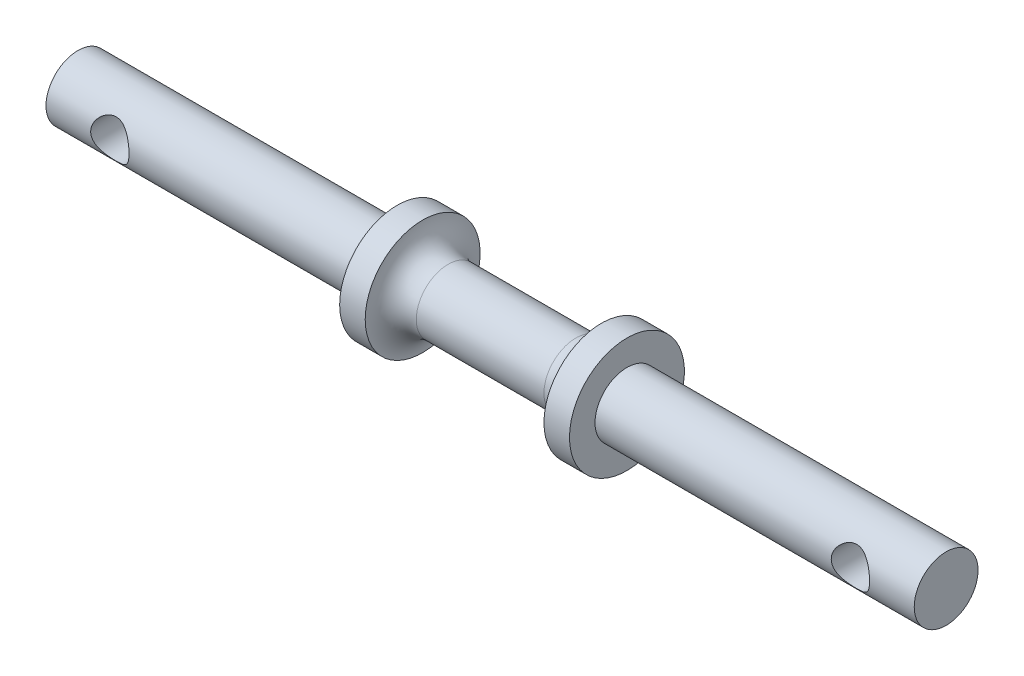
ISO-10303-21;
HEADER;
FILE_DESCRIPTION(('STEP AP214'),'2;1');
FILE_NAME('part.step','',(''),(''),'','','');
FILE_SCHEMA(('AUTOMOTIVE_DESIGN { 1 0 10303 214 1 1 1 1 }'));
ENDSEC;
DATA;
#1=APPLICATION_CONTEXT('core data for automotive mechanical design processes');
#2=APPLICATION_PROTOCOL_DEFINITION('international standard','automotive_design',2000,#1);
#3=PRODUCT_CONTEXT('',#1,'mechanical');
#4=PRODUCT('Part','Part','',(#3));
#5=PRODUCT_RELATED_PRODUCT_CATEGORY('part','',(#4));
#6=PRODUCT_DEFINITION_FORMATION('','',#4);
#7=PRODUCT_DEFINITION_CONTEXT('part definition',#1,'design');
#8=PRODUCT_DEFINITION('design','',#6,#7);
#9=PRODUCT_DEFINITION_SHAPE('','',#8);
#10=(LENGTH_UNIT() NAMED_UNIT(*) SI_UNIT(.MILLI.,.METRE.));
#11=(NAMED_UNIT(*) PLANE_ANGLE_UNIT() SI_UNIT($,.RADIAN.));
#12=(NAMED_UNIT(*) SI_UNIT($,.STERADIAN.) SOLID_ANGLE_UNIT());
#13=UNCERTAINTY_MEASURE_WITH_UNIT(LENGTH_MEASURE(1.E-05),#10,'distance_accuracy_value','');
#14=(GEOMETRIC_REPRESENTATION_CONTEXT(3) GLOBAL_UNCERTAINTY_ASSIGNED_CONTEXT((#13)) GLOBAL_UNIT_ASSIGNED_CONTEXT((#10,
#11,#12)) REPRESENTATION_CONTEXT('',''));
#15=CARTESIAN_POINT('',(0.,0.,0.));
#16=DIRECTION('',(0.,0.,1.));
#17=DIRECTION('',(1.,0.,0.));
#18=AXIS2_PLACEMENT_3D('',#15,#16,#17);
#19=CARTESIAN_POINT('',(0.,0.,0.));
#20=DIRECTION('',(1.,0.,0.));
#21=DIRECTION('',(0.,0.,-1.));
#22=AXIS2_PLACEMENT_3D('',#19,#20,#21);
#23=PLANE('',#22);
#24=CARTESIAN_POINT('',(0.,0.,0.));
#25=DIRECTION('',(-1.,0.,0.));
#26=DIRECTION('',(0.,0.,1.));
#27=AXIS2_PLACEMENT_3D('',#24,#25,#26);
#28=CIRCLE('',#27,2.5);
#29=CARTESIAN_POINT('',(0.,0.,2.5));
#30=VERTEX_POINT('',#29);
#31=EDGE_CURVE('E98',#30,#30,#28,.T.);
#32=ORIENTED_EDGE('',*,*,#31,.T.);
#33=EDGE_LOOP('',(#32));
#34=FACE_BOUND('',#33,.T.);
#35=ADVANCED_FACE('F28',(#34),#23,.F.);
#36=CARTESIAN_POINT('',(68.,0.,0.));
#37=DIRECTION('',(-1.,0.,0.));
#38=DIRECTION('',(0.,0.,1.));
#39=AXIS2_PLACEMENT_3D('',#36,#37,#38);
#40=PLANE('',#39);
#41=CARTESIAN_POINT('',(68.,0.,0.));
#42=DIRECTION('',(-1.,0.,0.));
#43=DIRECTION('',(0.,0.,1.));
#44=AXIS2_PLACEMENT_3D('',#41,#42,#43);
#45=CIRCLE('',#44,2.5);
#46=CARTESIAN_POINT('',(68.,0.,2.5));
#47=VERTEX_POINT('',#46);
#48=EDGE_CURVE('E10',#47,#47,#45,.T.);
#49=ORIENTED_EDGE('',*,*,#48,.F.);
#50=EDGE_LOOP('',(#49));
#51=FACE_BOUND('',#50,.T.);
#52=ADVANCED_FACE('F90',(#51),#40,.F.);
#53=CARTESIAN_POINT('',(0.,0.,0.));
#54=DIRECTION('',(-1.,0.,0.));
#55=DIRECTION('',(0.,0.,1.));
#56=AXIS2_PLACEMENT_3D('',#53,#54,#55);
#57=CYLINDRICAL_SURFACE('',#56,2.5);
#58=CARTESIAN_POINT('',(64.5,0.,2.5));
#59=CARTESIAN_POINT('',(64.4999959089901,-0.076729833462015,2.49999625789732));
#60=CARTESIAN_POINT('',(64.4940713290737,-0.153582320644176,2.4964290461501));
#61=CARTESIAN_POINT('',(64.4706756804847,-0.304975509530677,2.48249903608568));
#62=CARTESIAN_POINT('',(64.4531761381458,-0.379510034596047,2.47211948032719));
#63=CARTESIAN_POINT('',(64.4076136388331,-0.523751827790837,2.44561558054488));
#64=CARTESIAN_POINT('',(64.3796030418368,-0.593481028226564,2.42951973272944));
#65=CARTESIAN_POINT('',(64.314139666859,-0.727030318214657,2.39295367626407));
#66=CARTESIAN_POINT('',(64.2766892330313,-0.790851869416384,2.37248455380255));
#67=CARTESIAN_POINT('',(64.1902251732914,-0.916299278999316,2.32705360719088));
#68=CARTESIAN_POINT('',(64.1405463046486,-0.977384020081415,2.30186792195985));
#69=CARTESIAN_POINT('',(64.0325327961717,-1.09088270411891,2.25030439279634));
#70=CARTESIAN_POINT('',(63.9741870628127,-1.14328534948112,2.22392505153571));
#71=CARTESIAN_POINT('',(63.8420764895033,-1.24444996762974,2.1691106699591));
#72=CARTESIAN_POINT('',(63.7672982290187,-1.29197766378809,2.14082017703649));
#73=CARTESIAN_POINT('',(63.6091534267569,-1.37361437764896,2.08938301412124));
#74=CARTESIAN_POINT('',(63.5258011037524,-1.40774517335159,2.06622802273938));
#75=CARTESIAN_POINT('',(63.3734035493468,-1.45440601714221,2.0335462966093));
#76=CARTESIAN_POINT('',(63.3057640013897,-1.47016197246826,2.02207883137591));
#77=CARTESIAN_POINT('',(63.1681962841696,-1.49216172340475,2.00590308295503));
#78=CARTESIAN_POINT('',(63.0982710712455,-1.49841734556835,2.0011863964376));
#79=CARTESIAN_POINT('',(62.9579885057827,-1.50105508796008,1.99920922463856));
#80=CARTESIAN_POINT('',(62.8876305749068,-1.49741783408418,2.00196337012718));
#81=CARTESIAN_POINT('',(62.7487212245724,-1.48046060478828,2.01453261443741));
#82=CARTESIAN_POINT('',(62.6801712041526,-1.46713334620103,2.02435302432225));
#83=CARTESIAN_POINT('',(62.5474697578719,-1.43173921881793,2.04953186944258));
#84=CARTESIAN_POINT('',(62.4832729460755,-1.40978748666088,2.06481711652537));
#85=CARTESIAN_POINT('',(62.3593050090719,-1.35795061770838,2.09927051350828));
#86=CARTESIAN_POINT('',(62.2995355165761,-1.32806257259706,2.11844008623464));
#87=CARTESIAN_POINT('',(62.1750159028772,-1.25517983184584,2.16255327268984));
#88=CARTESIAN_POINT('',(62.1112219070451,-1.21080724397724,2.18792043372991));
#89=CARTESIAN_POINT('',(61.991323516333,-1.11291092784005,2.2393059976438));
#90=CARTESIAN_POINT('',(61.9352265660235,-1.0593784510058,2.26532500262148));
#91=CARTESIAN_POINT('',(61.8243870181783,-0.935811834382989,2.31935504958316));
#92=CARTESIAN_POINT('',(61.770922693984,-0.864517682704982,2.34713836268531));
#93=CARTESIAN_POINT('',(61.6768779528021,-0.712276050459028,2.3977242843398));
#94=CARTESIAN_POINT('',(61.6362906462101,-0.631333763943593,2.42052955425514));
#95=CARTESIAN_POINT('',(61.5720678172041,-0.467197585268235,2.45730392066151));
#96=CARTESIAN_POINT('',(61.5475246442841,-0.384467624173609,2.47173957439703));
#97=CARTESIAN_POINT('',(61.5129888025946,-0.215047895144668,2.4921884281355));
#98=CARTESIAN_POINT('',(61.5029786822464,-0.128363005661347,2.49821172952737));
#99=CARTESIAN_POINT('',(61.4984921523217,0.0337146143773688,2.5009057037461));
#100=CARTESIAN_POINT('',(61.5020911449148,0.10904247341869,2.49873521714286));
#101=CARTESIAN_POINT('',(61.5204258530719,0.257829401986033,2.48778712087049));
#102=CARTESIAN_POINT('',(61.5351613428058,0.331288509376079,2.47900964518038));
#103=CARTESIAN_POINT('',(61.5745434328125,0.472574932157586,2.45594792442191));
#104=CARTESIAN_POINT('',(61.5989403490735,0.540495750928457,2.44180275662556));
#105=CARTESIAN_POINT('',(61.6566773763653,0.671265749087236,2.40913880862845));
#106=CARTESIAN_POINT('',(61.6900192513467,0.734113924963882,2.39061916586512));
#107=CARTESIAN_POINT('',(61.7685569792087,0.860006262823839,2.34845496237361));
#108=CARTESIAN_POINT('',(61.8146238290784,0.922394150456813,2.32447802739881));
#109=CARTESIAN_POINT('',(61.9153913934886,1.03902603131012,2.27474265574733));
#110=CARTESIAN_POINT('',(61.9701021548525,1.09326040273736,2.24898216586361));
#111=CARTESIAN_POINT('',(62.0949103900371,1.19931996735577,2.19445423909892));
#112=CARTESIAN_POINT('',(62.1660838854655,1.24991019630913,2.16573241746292));
#113=CARTESIAN_POINT('',(62.3172160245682,1.33845238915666,2.11216182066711));
#114=CARTESIAN_POINT('',(62.3971652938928,1.37641766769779,2.08730897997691));
#115=CARTESIAN_POINT('',(62.5462430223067,1.43142578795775,2.0498490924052));
#116=CARTESIAN_POINT('',(62.6139803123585,1.45121625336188,2.0357565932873));
#117=CARTESIAN_POINT('',(62.7525320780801,1.48113663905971,2.01409605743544));
#118=CARTESIAN_POINT('',(62.8233421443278,1.4912799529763,2.00651897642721));
#119=CARTESIAN_POINT('',(62.966376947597,1.50134130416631,1.99900446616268));
#120=CARTESIAN_POINT('',(63.038605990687,1.50122089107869,1.99909576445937));
#121=CARTESIAN_POINT('',(63.1818944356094,1.49066472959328,2.0069771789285));
#122=CARTESIAN_POINT('',(63.2529531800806,1.48022337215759,2.0147714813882));
#123=CARTESIAN_POINT('',(63.3884884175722,1.45040174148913,2.0363318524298));
#124=CARTESIAN_POINT('',(63.4531170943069,1.43147636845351,2.0497921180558));
#125=CARTESIAN_POINT('',(63.5783372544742,1.38563242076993,2.08105501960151));
#126=CARTESIAN_POINT('',(63.6389272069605,1.3587108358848,2.09885929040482));
#127=CARTESIAN_POINT('',(63.7643198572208,1.29289245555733,2.14012990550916));
#128=CARTESIAN_POINT('',(63.8283411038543,1.25279167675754,2.16404587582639));
#129=CARTESIAN_POINT('',(63.9493800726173,1.16375698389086,2.21320127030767));
#130=CARTESIAN_POINT('',(64.0063919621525,1.114815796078,2.2384417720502));
#131=CARTESIAN_POINT('',(64.1213509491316,1.00009777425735,2.29225690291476));
#132=CARTESIAN_POINT('',(64.1779310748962,0.932876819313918,2.32070308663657));
#133=CARTESIAN_POINT('',(64.2790978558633,0.788462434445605,2.37365428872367));
#134=CARTESIAN_POINT('',(64.3236802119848,0.711265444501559,2.39815789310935));
#135=CARTESIAN_POINT('',(64.3977858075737,0.551125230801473,2.43985578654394));
#136=CARTESIAN_POINT('',(64.4277280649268,0.468430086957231,2.45725077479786));
#137=CARTESIAN_POINT('',(64.472724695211,0.297973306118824,2.48366273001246));
#138=CARTESIAN_POINT('',(64.487835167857,0.210232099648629,2.49271125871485));
#139=CARTESIAN_POINT('',(64.4966974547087,0.10155809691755,2.49802001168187));
#140=CARTESIAN_POINT('',(64.4979344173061,0.0812762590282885,2.49876114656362));
#141=CARTESIAN_POINT('',(64.4995862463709,0.0406658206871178,2.49975164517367));
#142=CARTESIAN_POINT('',(64.5000010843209,0.0203372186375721,2.50000099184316));
#143=CARTESIAN_POINT('',(64.5,0.,2.5));
#144=B_SPLINE_CURVE_WITH_KNOTS('',3,(#58,#59,#60,#61,#62,#63,#64,#65,#66,#67,#68,#69,#70,#71,
#72,#73,#74,#75,#76,#77,#78,#79,#80,#81,#82,#83,#84,#85,#86,#87,#88,#89,#90,#91,#92,#93,#94,#95,
#96,#97,#98,#99,#100,#101,#102,#103,#104,#105,#106,#107,#108,#109,#110,#111,#112,#113,#114,#115,
#116,#117,#118,#119,#120,#121,#122,#123,#124,#125,#126,#127,#128,#129,#130,#131,#132,#133,#134,
#135,#136,#137,#138,#139,#140,#141,#142,#143),.UNSPECIFIED.,.T.,.F.,(4,2,2,2,2,2,2,2,2,2,2,2,2,
2,2,2,2,2,2,2,2,2,2,2,2,2,2,2,2,2,2,2,2,2,2,2,2,2,2,2,2,2,4),(0.,0.230102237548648,
0.460772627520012,0.690308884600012,0.919788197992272,1.16681590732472,1.414162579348,
1.69183813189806,1.96906040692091,2.17933829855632,2.38935420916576,2.59978170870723,
2.81036753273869,3.01823267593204,3.22617409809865,3.47046995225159,3.7150004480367,
3.99360957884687,4.2720693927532,4.53296790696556,4.79355286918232,5.01875602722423,
5.24395461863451,5.46367785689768,5.68344445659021,5.92601365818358,6.16886690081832,
6.44336762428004,6.71757792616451,6.93257787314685,7.14727888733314,7.3627842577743,
7.57840681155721,7.78364098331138,7.98895251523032,8.22578610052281,8.46281544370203,
8.73854311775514,9.01436946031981,9.28175654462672,9.54812832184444,9.60911473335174,
9.67010326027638),.UNSPECIFIED.);
#145=CARTESIAN_POINT('',(64.5,0.,2.5));
#146=VERTEX_POINT('',#145);
#147=EDGE_CURVE('E55',#146,#146,#144,.T.);
#148=ORIENTED_EDGE('',*,*,#147,.T.);
#149=EDGE_LOOP('',(#148));
#150=FACE_BOUND('',#149,.T.);
#151=CARTESIAN_POINT('',(64.5,0.,-2.5));
#152=CARTESIAN_POINT('',(64.4999959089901,0.0767298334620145,-2.49999625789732));
#153=CARTESIAN_POINT('',(64.4940713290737,0.153582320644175,-2.4964290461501));
#154=CARTESIAN_POINT('',(64.4706756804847,0.304975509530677,-2.48249903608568));
#155=CARTESIAN_POINT('',(64.4531761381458,0.379510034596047,-2.47211948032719));
#156=CARTESIAN_POINT('',(64.4076136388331,0.523751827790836,-2.44561558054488));
#157=CARTESIAN_POINT('',(64.3796030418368,0.593481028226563,-2.42951973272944));
#158=CARTESIAN_POINT('',(64.314139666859,0.727030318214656,-2.39295367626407));
#159=CARTESIAN_POINT('',(64.2766892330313,0.790851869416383,-2.37248455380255));
#160=CARTESIAN_POINT('',(64.1902251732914,0.916299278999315,-2.32705360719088));
#161=CARTESIAN_POINT('',(64.1405463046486,0.977384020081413,-2.30186792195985));
#162=CARTESIAN_POINT('',(64.0325327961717,1.09088270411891,-2.25030439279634));
#163=CARTESIAN_POINT('',(63.9741870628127,1.14328534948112,-2.22392505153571));
#164=CARTESIAN_POINT('',(63.8420764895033,1.24444996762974,-2.1691106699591));
#165=CARTESIAN_POINT('',(63.7672982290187,1.29197766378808,-2.14082017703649));
#166=CARTESIAN_POINT('',(63.6091534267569,1.37361437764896,-2.08938301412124));
#167=CARTESIAN_POINT('',(63.5258011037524,1.40774517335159,-2.06622802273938));
#168=CARTESIAN_POINT('',(63.3734035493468,1.45440601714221,-2.0335462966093));
#169=CARTESIAN_POINT('',(63.3057640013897,1.47016197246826,-2.02207883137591));
#170=CARTESIAN_POINT('',(63.1681962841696,1.49216172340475,-2.00590308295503));
#171=CARTESIAN_POINT('',(63.0982710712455,1.49841734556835,-2.0011863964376));
#172=CARTESIAN_POINT('',(62.9579885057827,1.50105508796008,-1.99920922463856));
#173=CARTESIAN_POINT('',(62.8876305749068,1.49741783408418,-2.00196337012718));
#174=CARTESIAN_POINT('',(62.7487212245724,1.48046060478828,-2.01453261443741));
#175=CARTESIAN_POINT('',(62.6801712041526,1.46713334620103,-2.02435302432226));
#176=CARTESIAN_POINT('',(62.5474697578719,1.43173921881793,-2.04953186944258));
#177=CARTESIAN_POINT('',(62.4832729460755,1.40978748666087,-2.06481711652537));
#178=CARTESIAN_POINT('',(62.3593050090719,1.35795061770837,-2.09927051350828));
#179=CARTESIAN_POINT('',(62.2995355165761,1.32806257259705,-2.11844008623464));
#180=CARTESIAN_POINT('',(62.1750159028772,1.25517983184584,-2.16255327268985));
#181=CARTESIAN_POINT('',(62.1112219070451,1.21080724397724,-2.18792043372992));
#182=CARTESIAN_POINT('',(61.991323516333,1.11291092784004,-2.2393059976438));
#183=CARTESIAN_POINT('',(61.9352265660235,1.0593784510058,-2.26532500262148));
#184=CARTESIAN_POINT('',(61.8243870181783,0.935811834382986,-2.31935504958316));
#185=CARTESIAN_POINT('',(61.770922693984,0.864517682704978,-2.34713836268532));
#186=CARTESIAN_POINT('',(61.6768779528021,0.712276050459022,-2.3977242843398));
#187=CARTESIAN_POINT('',(61.6362906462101,0.631333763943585,-2.42052955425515));
#188=CARTESIAN_POINT('',(61.5720678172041,0.467197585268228,-2.45730392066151));
#189=CARTESIAN_POINT('',(61.5475246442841,0.384467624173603,-2.47173957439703));
#190=CARTESIAN_POINT('',(61.5129888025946,0.215047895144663,-2.4921884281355));
#191=CARTESIAN_POINT('',(61.5029786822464,0.128363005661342,-2.49821172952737));
#192=CARTESIAN_POINT('',(61.4984921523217,-0.0337146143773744,-2.5009057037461));
#193=CARTESIAN_POINT('',(61.5020911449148,-0.109042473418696,-2.49873521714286));
#194=CARTESIAN_POINT('',(61.5204258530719,-0.257829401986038,-2.48778712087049));
#195=CARTESIAN_POINT('',(61.5351613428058,-0.331288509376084,-2.47900964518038));
#196=CARTESIAN_POINT('',(61.5745434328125,-0.472574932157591,-2.45594792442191));
#197=CARTESIAN_POINT('',(61.5989403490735,-0.540495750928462,-2.44180275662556));
#198=CARTESIAN_POINT('',(61.6566773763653,-0.671265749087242,-2.40913880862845));
#199=CARTESIAN_POINT('',(61.6900192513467,-0.734113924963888,-2.39061916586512));
#200=CARTESIAN_POINT('',(61.7685569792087,-0.860006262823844,-2.34845496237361));
#201=CARTESIAN_POINT('',(61.8146238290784,-0.922394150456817,-2.32447802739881));
#202=CARTESIAN_POINT('',(61.9153913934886,-1.03902603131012,-2.27474265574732));
#203=CARTESIAN_POINT('',(61.9701021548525,-1.09326040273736,-2.24898216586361));
#204=CARTESIAN_POINT('',(62.0949103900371,-1.19931996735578,-2.19445423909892));
#205=CARTESIAN_POINT('',(62.1660838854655,-1.24991019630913,-2.16573241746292));
#206=CARTESIAN_POINT('',(62.3172160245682,-1.33845238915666,-2.11216182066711));
#207=CARTESIAN_POINT('',(62.3971652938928,-1.3764176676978,-2.0873089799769));
#208=CARTESIAN_POINT('',(62.5462430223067,-1.43142578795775,-2.0498490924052));
#209=CARTESIAN_POINT('',(62.6139803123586,-1.45121625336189,-2.03575659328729));
#210=CARTESIAN_POINT('',(62.7525320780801,-1.48113663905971,-2.01409605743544));
#211=CARTESIAN_POINT('',(62.8233421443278,-1.4912799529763,-2.00651897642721));
#212=CARTESIAN_POINT('',(62.966376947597,-1.50134130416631,-1.99900446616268));
#213=CARTESIAN_POINT('',(63.038605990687,-1.50122089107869,-1.99909576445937));
#214=CARTESIAN_POINT('',(63.1818944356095,-1.49066472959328,-2.0069771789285));
#215=CARTESIAN_POINT('',(63.2529531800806,-1.48022337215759,-2.0147714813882));
#216=CARTESIAN_POINT('',(63.3884884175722,-1.45040174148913,-2.0363318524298));
#217=CARTESIAN_POINT('',(63.4531170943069,-1.43147636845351,-2.04979211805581));
#218=CARTESIAN_POINT('',(63.5783372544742,-1.38563242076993,-2.08105501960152));
#219=CARTESIAN_POINT('',(63.6389272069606,-1.35871083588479,-2.09885929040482));
#220=CARTESIAN_POINT('',(63.7643198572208,-1.29289245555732,-2.14012990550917));
#221=CARTESIAN_POINT('',(63.8283411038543,-1.25279167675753,-2.1640458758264));
#222=CARTESIAN_POINT('',(63.9493800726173,-1.16375698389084,-2.21320127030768));
#223=CARTESIAN_POINT('',(64.0063919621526,-1.11481579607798,-2.23844177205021));
#224=CARTESIAN_POINT('',(64.1213509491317,-1.00009777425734,-2.29225690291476));
#225=CARTESIAN_POINT('',(64.1779310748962,-0.932876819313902,-2.32070308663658));
#226=CARTESIAN_POINT('',(64.2790978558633,-0.788462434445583,-2.37365428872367));
#227=CARTESIAN_POINT('',(64.3236802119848,-0.711265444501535,-2.39815789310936));
#228=CARTESIAN_POINT('',(64.3977858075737,-0.551125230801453,-2.43985578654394));
#229=CARTESIAN_POINT('',(64.4277280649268,-0.468430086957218,-2.45725077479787));
#230=CARTESIAN_POINT('',(64.472724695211,-0.297973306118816,-2.48366273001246));
#231=CARTESIAN_POINT('',(64.487835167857,-0.210232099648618,-2.49271125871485));
#232=CARTESIAN_POINT('',(64.4966974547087,-0.101558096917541,-2.49802001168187));
#233=CARTESIAN_POINT('',(64.4979344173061,-0.0812762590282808,-2.49876114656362));
#234=CARTESIAN_POINT('',(64.4995862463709,-0.040665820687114,-2.49975164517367));
#235=CARTESIAN_POINT('',(64.5000010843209,-0.0203372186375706,-2.50000099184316));
#236=CARTESIAN_POINT('',(64.5,0.,-2.5));
#237=B_SPLINE_CURVE_WITH_KNOTS('',3,(#151,#152,#153,#154,#155,#156,#157,#158,#159,#160,#161,
#162,#163,#164,#165,#166,#167,#168,#169,#170,#171,#172,#173,#174,#175,#176,#177,#178,#179,#180,
#181,#182,#183,#184,#185,#186,#187,#188,#189,#190,#191,#192,#193,#194,#195,#196,#197,#198,#199,
#200,#201,#202,#203,#204,#205,#206,#207,#208,#209,#210,#211,#212,#213,#214,#215,#216,#217,#218,
#219,#220,#221,#222,#223,#224,#225,#226,#227,#228,#229,#230,#231,#232,#233,#234,#235,#236),
.UNSPECIFIED.,.T.,.F.,(4,2,2,2,2,2,2,2,2,2,2,2,2,2,2,2,2,2,2,2,2,2,2,2,2,2,2,2,2,2,2,2,2,2,2,2,
2,2,2,2,2,2,4),(0.,0.230102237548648,0.460772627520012,0.690308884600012,0.919788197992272,
1.16681590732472,1.414162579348,1.69183813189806,1.96906040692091,2.17933829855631,
2.38935420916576,2.59978170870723,2.8103675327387,3.01823267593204,3.22617409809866,
3.47046995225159,3.7150004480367,3.99360957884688,4.27206939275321,4.53296790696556,
4.79355286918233,5.01875602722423,5.24395461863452,5.46367785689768,5.68344445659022,
5.92601365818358,6.16886690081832,6.44336762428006,6.71757792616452,6.93257787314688,
7.14727888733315,7.3627842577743,7.57840681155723,7.7836409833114,7.98895251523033,
8.22578610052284,8.46281544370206,8.73854311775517,9.01436946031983,9.28175654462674,
9.54812832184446,9.60911473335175,9.67010326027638),.UNSPECIFIED.);
#238=CARTESIAN_POINT('',(64.5,0.,-2.5));
#239=VERTEX_POINT('',#238);
#240=EDGE_CURVE('E48',#239,#239,#237,.T.);
#241=ORIENTED_EDGE('',*,*,#240,.T.);
#242=EDGE_LOOP('',(#241));
#243=FACE_BOUND('',#242,.T.);
#244=CARTESIAN_POINT('',(43.,0.,0.));
#245=DIRECTION('',(-1.,0.,0.));
#246=DIRECTION('',(0.,0.,1.));
#247=AXIS2_PLACEMENT_3D('',#244,#245,#246);
#248=CIRCLE('',#247,2.5);
#249=CARTESIAN_POINT('',(43.,0.,2.5));
#250=VERTEX_POINT('',#249);
#251=EDGE_CURVE('E39',#250,#250,#248,.T.);
#252=ORIENTED_EDGE('',*,*,#251,.F.);
#253=EDGE_LOOP('',(#252));
#254=FACE_BOUND('',#253,.T.);
#255=ORIENTED_EDGE('',*,*,#48,.T.);
#256=EDGE_LOOP('',(#255));
#257=FACE_BOUND('',#256,.T.);
#258=ADVANCED_FACE('F58',(#150,#243,#254,#257),#57,.T.);
#259=CARTESIAN_POINT('',(43.,2.5,0.));
#260=DIRECTION('',(-1.,0.,0.));
#261=DIRECTION('',(0.,0.,1.));
#262=AXIS2_PLACEMENT_3D('',#259,#260,#261);
#263=PLANE('',#262);
#264=CARTESIAN_POINT('',(43.,0.,0.));
#265=DIRECTION('',(-1.,0.,0.));
#266=DIRECTION('',(0.,0.,1.));
#267=AXIS2_PLACEMENT_3D('',#264,#265,#266);
#268=CIRCLE('',#267,4.5);
#269=CARTESIAN_POINT('',(43.,0.,4.5));
#270=VERTEX_POINT('',#269);
#271=EDGE_CURVE('E44',#270,#270,#268,.T.);
#272=ORIENTED_EDGE('',*,*,#271,.F.);
#273=EDGE_LOOP('',(#272));
#274=FACE_BOUND('',#273,.T.);
#275=ORIENTED_EDGE('',*,*,#251,.T.);
#276=EDGE_LOOP('',(#275));
#277=FACE_BOUND('',#276,.T.);
#278=ADVANCED_FACE('F125',(#274,#277),#263,.F.);
#279=CARTESIAN_POINT('',(0.,0.,0.));
#280=DIRECTION('',(-1.,0.,0.));
#281=DIRECTION('',(0.,0.,1.));
#282=AXIS2_PLACEMENT_3D('',#279,#280,#281);
#283=CYLINDRICAL_SURFACE('',#282,4.5);
#284=CARTESIAN_POINT('',(41.,0.,0.));
#285=DIRECTION('',(-1.,0.,0.));
#286=DIRECTION('',(0.,0.,1.));
#287=AXIS2_PLACEMENT_3D('',#284,#285,#286);
#288=CIRCLE('',#287,4.5);
#289=CARTESIAN_POINT('',(41.,0.,4.5));
#290=VERTEX_POINT('',#289);
#291=EDGE_CURVE('E118',#290,#290,#288,.T.);
#292=ORIENTED_EDGE('',*,*,#291,.F.);
#293=EDGE_LOOP('',(#292));
#294=FACE_BOUND('',#293,.T.);
#295=ORIENTED_EDGE('',*,*,#271,.T.);
#296=EDGE_LOOP('',(#295));
#297=FACE_BOUND('',#296,.T.);
#298=ADVANCED_FACE('F123',(#294,#297),#283,.T.);
#299=CARTESIAN_POINT('',(39.,0.,0.));
#300=DIRECTION('',(-1.,0.,0.));
#301=DIRECTION('',(0.,0.,1.));
#302=AXIS2_PLACEMENT_3D('',#299,#300,#301);
#303=TOROIDAL_SURFACE('',#302,4.5,2.);
#304=CARTESIAN_POINT('',(39.,0.,0.));
#305=DIRECTION('',(-1.,0.,0.));
#306=DIRECTION('',(0.,0.,1.));
#307=AXIS2_PLACEMENT_3D('',#304,#305,#306);
#308=CIRCLE('',#307,2.5);
#309=CARTESIAN_POINT('',(39.,0.,2.5));
#310=VERTEX_POINT('',#309);
#311=EDGE_CURVE('E115',#310,#310,#308,.T.);
#312=ORIENTED_EDGE('',*,*,#311,.F.);
#313=EDGE_LOOP('',(#312));
#314=FACE_BOUND('',#313,.T.);
#315=ORIENTED_EDGE('',*,*,#291,.T.);
#316=EDGE_LOOP('',(#315));
#317=FACE_BOUND('',#316,.T.);
#318=ADVANCED_FACE('F152',(#314,#317),#303,.F.);
#319=CARTESIAN_POINT('',(0.,0.,0.));
#320=DIRECTION('',(-1.,0.,0.));
#321=DIRECTION('',(0.,0.,1.));
#322=AXIS2_PLACEMENT_3D('',#319,#320,#321);
#323=CYLINDRICAL_SURFACE('',#322,2.5);
#324=CARTESIAN_POINT('',(29.,0.,0.));
#325=DIRECTION('',(-1.,0.,0.));
#326=DIRECTION('',(0.,0.,1.));
#327=AXIS2_PLACEMENT_3D('',#324,#325,#326);
#328=CIRCLE('',#327,2.5);
#329=CARTESIAN_POINT('',(29.,0.,2.5));
#330=VERTEX_POINT('',#329);
#331=EDGE_CURVE('E112',#330,#330,#328,.T.);
#332=ORIENTED_EDGE('',*,*,#331,.F.);
#333=EDGE_LOOP('',(#332));
#334=FACE_BOUND('',#333,.T.);
#335=ORIENTED_EDGE('',*,*,#311,.T.);
#336=EDGE_LOOP('',(#335));
#337=FACE_BOUND('',#336,.T.);
#338=ADVANCED_FACE('F160',(#334,#337),#323,.T.);
#339=CARTESIAN_POINT('',(29.,0.,0.));
#340=DIRECTION('',(-1.,0.,0.));
#341=DIRECTION('',(0.,0.,1.));
#342=AXIS2_PLACEMENT_3D('',#339,#340,#341);
#343=TOROIDAL_SURFACE('',#342,4.5,2.);
#344=CARTESIAN_POINT('',(27.,0.,0.));
#345=DIRECTION('',(-1.,0.,0.));
#346=DIRECTION('',(0.,0.,1.));
#347=AXIS2_PLACEMENT_3D('',#344,#345,#346);
#348=CIRCLE('',#347,4.5);
#349=CARTESIAN_POINT('',(27.,0.,4.5));
#350=VERTEX_POINT('',#349);
#351=EDGE_CURVE('E109',#350,#350,#348,.T.);
#352=ORIENTED_EDGE('',*,*,#351,.F.);
#353=EDGE_LOOP('',(#352));
#354=FACE_BOUND('',#353,.T.);
#355=ORIENTED_EDGE('',*,*,#331,.T.);
#356=EDGE_LOOP('',(#355));
#357=FACE_BOUND('',#356,.T.);
#358=ADVANCED_FACE('F168',(#354,#357),#343,.F.);
#359=CARTESIAN_POINT('',(0.,0.,0.));
#360=DIRECTION('',(-1.,0.,0.));
#361=DIRECTION('',(0.,0.,1.));
#362=AXIS2_PLACEMENT_3D('',#359,#360,#361);
#363=CYLINDRICAL_SURFACE('',#362,4.5);
#364=CARTESIAN_POINT('',(25.,0.,0.));
#365=DIRECTION('',(-1.,0.,0.));
#366=DIRECTION('',(0.,0.,1.));
#367=AXIS2_PLACEMENT_3D('',#364,#365,#366);
#368=CIRCLE('',#367,4.5);
#369=CARTESIAN_POINT('',(25.,0.,4.5));
#370=VERTEX_POINT('',#369);
#371=EDGE_CURVE('E103',#370,#370,#368,.T.);
#372=ORIENTED_EDGE('',*,*,#371,.F.);
#373=EDGE_LOOP('',(#372));
#374=FACE_BOUND('',#373,.T.);
#375=ORIENTED_EDGE('',*,*,#351,.T.);
#376=EDGE_LOOP('',(#375));
#377=FACE_BOUND('',#376,.T.);
#378=ADVANCED_FACE('F176',(#374,#377),#363,.T.);
#379=CARTESIAN_POINT('',(25.,2.5,0.));
#380=DIRECTION('',(1.,0.,0.));
#381=DIRECTION('',(0.,0.,-1.));
#382=AXIS2_PLACEMENT_3D('',#379,#380,#381);
#383=PLANE('',#382);
#384=CARTESIAN_POINT('',(25.,0.,0.));
#385=DIRECTION('',(-1.,0.,0.));
#386=DIRECTION('',(0.,0.,1.));
#387=AXIS2_PLACEMENT_3D('',#384,#385,#386);
#388=CIRCLE('',#387,2.5);
#389=CARTESIAN_POINT('',(25.,0.,2.5));
#390=VERTEX_POINT('',#389);
#391=EDGE_CURVE('E100',#390,#390,#388,.T.);
#392=ORIENTED_EDGE('',*,*,#391,.F.);
#393=EDGE_LOOP('',(#392));
#394=FACE_BOUND('',#393,.T.);
#395=ORIENTED_EDGE('',*,*,#371,.T.);
#396=EDGE_LOOP('',(#395));
#397=FACE_BOUND('',#396,.T.);
#398=ADVANCED_FACE('F72',(#394,#397),#383,.F.);
#399=CARTESIAN_POINT('',(0.,0.,0.));
#400=DIRECTION('',(-1.,0.,0.));
#401=DIRECTION('',(0.,0.,1.));
#402=AXIS2_PLACEMENT_3D('',#399,#400,#401);
#403=CYLINDRICAL_SURFACE('',#402,2.5);
#404=CARTESIAN_POINT('',(6.5,0.,2.5));
#405=CARTESIAN_POINT('',(6.49999590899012,-0.0767298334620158,2.49999625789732));
#406=CARTESIAN_POINT('',(6.49407132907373,-0.153582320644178,2.4964290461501));
#407=CARTESIAN_POINT('',(6.47067568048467,-0.304975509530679,2.48249903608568));
#408=CARTESIAN_POINT('',(6.45317613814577,-0.379510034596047,2.47211948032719));
#409=CARTESIAN_POINT('',(6.40761363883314,-0.523751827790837,2.44561558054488));
#410=CARTESIAN_POINT('',(6.37960304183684,-0.593481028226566,2.42951973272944));
#411=CARTESIAN_POINT('',(6.31413966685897,-0.727030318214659,2.39295367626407));
#412=CARTESIAN_POINT('',(6.27668923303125,-0.790851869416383,2.37248455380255));
#413=CARTESIAN_POINT('',(6.19022517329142,-0.916299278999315,2.32705360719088));
#414=CARTESIAN_POINT('',(6.14054630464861,-0.977384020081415,2.30186792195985));
#415=CARTESIAN_POINT('',(6.03253279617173,-1.09088270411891,2.25030439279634));
#416=CARTESIAN_POINT('',(5.97418706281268,-1.14328534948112,2.22392505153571));
#417=CARTESIAN_POINT('',(5.84207648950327,-1.24444996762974,2.1691106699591));
#418=CARTESIAN_POINT('',(5.76729822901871,-1.29197766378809,2.14082017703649));
#419=CARTESIAN_POINT('',(5.60915342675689,-1.37361437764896,2.08938301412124));
#420=CARTESIAN_POINT('',(5.52580110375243,-1.4077451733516,2.06622802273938));
#421=CARTESIAN_POINT('',(5.37340354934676,-1.45440601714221,2.0335462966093));
#422=CARTESIAN_POINT('',(5.30576400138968,-1.47016197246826,2.02207883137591));
#423=CARTESIAN_POINT('',(5.16819628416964,-1.49216172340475,2.00590308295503));
#424=CARTESIAN_POINT('',(5.09827107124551,-1.49841734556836,2.0011863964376));
#425=CARTESIAN_POINT('',(4.95798850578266,-1.50105508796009,1.99920922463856));
#426=CARTESIAN_POINT('',(4.8876305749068,-1.49741783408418,2.00196337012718));
#427=CARTESIAN_POINT('',(4.74872122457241,-1.48046060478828,2.01453261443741));
#428=CARTESIAN_POINT('',(4.68017120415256,-1.46713334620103,2.02435302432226));
#429=CARTESIAN_POINT('',(4.5474697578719,-1.43173921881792,2.04953186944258));
#430=CARTESIAN_POINT('',(4.48327294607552,-1.40978748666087,2.06481711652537));
#431=CARTESIAN_POINT('',(4.35930500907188,-1.35795061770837,2.09927051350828));
#432=CARTESIAN_POINT('',(4.29953551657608,-1.32806257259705,2.11844008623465));
#433=CARTESIAN_POINT('',(4.1750159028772,-1.25517983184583,2.16255327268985));
#434=CARTESIAN_POINT('',(4.11122190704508,-1.21080724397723,2.18792043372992));
#435=CARTESIAN_POINT('',(3.99132351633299,-1.11291092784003,2.23930599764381));
#436=CARTESIAN_POINT('',(3.93522656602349,-1.05937845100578,2.26532500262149));
#437=CARTESIAN_POINT('',(3.82438701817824,-0.935811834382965,2.31935504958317));
#438=CARTESIAN_POINT('',(3.77092269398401,-0.864517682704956,2.34713836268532));
#439=CARTESIAN_POINT('',(3.67687795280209,-0.712276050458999,2.39772428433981));
#440=CARTESIAN_POINT('',(3.63629064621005,-0.631333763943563,2.42052955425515));
#441=CARTESIAN_POINT('',(3.5720678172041,-0.467197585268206,2.45730392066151));
#442=CARTESIAN_POINT('',(3.54752464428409,-0.38446762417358,2.47173957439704));
#443=CARTESIAN_POINT('',(3.51298880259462,-0.215047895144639,2.49218842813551));
#444=CARTESIAN_POINT('',(3.50297868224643,-0.128363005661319,2.49821172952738));
#445=CARTESIAN_POINT('',(3.49849215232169,0.0337146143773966,2.5009057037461));
#446=CARTESIAN_POINT('',(3.50209114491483,0.109042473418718,2.49873521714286));
#447=CARTESIAN_POINT('',(3.52042585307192,0.257829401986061,2.48778712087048));
#448=CARTESIAN_POINT('',(3.53516134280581,0.331288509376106,2.47900964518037));
#449=CARTESIAN_POINT('',(3.57454343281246,0.472574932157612,2.4559479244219));
#450=CARTESIAN_POINT('',(3.59894034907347,0.540495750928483,2.44180275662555));
#451=CARTESIAN_POINT('',(3.65667737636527,0.671265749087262,2.40913880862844));
#452=CARTESIAN_POINT('',(3.69001925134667,0.734113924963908,2.39061916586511));
#453=CARTESIAN_POINT('',(3.76855697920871,0.860006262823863,2.3484549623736));
#454=CARTESIAN_POINT('',(3.81462382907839,0.922394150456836,2.3244780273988));
#455=CARTESIAN_POINT('',(3.91539139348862,1.03902603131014,2.27474265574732));
#456=CARTESIAN_POINT('',(3.97010215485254,1.09326040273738,2.2489821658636));
#457=CARTESIAN_POINT('',(4.09491039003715,1.19931996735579,2.19445423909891));
#458=CARTESIAN_POINT('',(4.1660838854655,1.24991019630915,2.16573241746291));
#459=CARTESIAN_POINT('',(4.3172160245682,1.33845238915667,2.1121618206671));
#460=CARTESIAN_POINT('',(4.39716529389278,1.37641766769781,2.0873089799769));
#461=CARTESIAN_POINT('',(4.54624302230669,1.43142578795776,2.04984909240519));
#462=CARTESIAN_POINT('',(4.61398031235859,1.4512162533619,2.03575659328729));
#463=CARTESIAN_POINT('',(4.7525320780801,1.48113663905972,2.01409605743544));
#464=CARTESIAN_POINT('',(4.82334214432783,1.4912799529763,2.00651897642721));
#465=CARTESIAN_POINT('',(4.96637694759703,1.50134130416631,1.99900446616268));
#466=CARTESIAN_POINT('',(5.03860599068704,1.50122089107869,1.99909576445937));
#467=CARTESIAN_POINT('',(5.18189443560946,1.49066472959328,2.0069771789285));
#468=CARTESIAN_POINT('',(5.25295318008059,1.48022337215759,2.0147714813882));
#469=CARTESIAN_POINT('',(5.38848841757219,1.45040174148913,2.0363318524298));
#470=CARTESIAN_POINT('',(5.45311709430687,1.43147636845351,2.04979211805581));
#471=CARTESIAN_POINT('',(5.57833725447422,1.38563242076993,2.08105501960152));
#472=CARTESIAN_POINT('',(5.63892720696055,1.35871083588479,2.09885929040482));
#473=CARTESIAN_POINT('',(5.76431985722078,1.29289245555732,2.14012990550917));
#474=CARTESIAN_POINT('',(5.82834110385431,1.25279167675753,2.16404587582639));
#475=CARTESIAN_POINT('',(5.94938007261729,1.16375698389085,2.21320127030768));
#476=CARTESIAN_POINT('',(6.00639196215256,1.11481579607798,2.23844177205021));
#477=CARTESIAN_POINT('',(6.12135094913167,1.00009777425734,2.29225690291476));
#478=CARTESIAN_POINT('',(6.17793107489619,0.932876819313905,2.32070308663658));
#479=CARTESIAN_POINT('',(6.27909785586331,0.788462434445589,2.37365428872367));
#480=CARTESIAN_POINT('',(6.32368021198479,0.71126544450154,2.39815789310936));
#481=CARTESIAN_POINT('',(6.39778580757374,0.551125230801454,2.43985578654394));
#482=CARTESIAN_POINT('',(6.42772806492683,0.468430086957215,2.45725077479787));
#483=CARTESIAN_POINT('',(6.47272469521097,0.297973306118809,2.48366273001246));
#484=CARTESIAN_POINT('',(6.48783516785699,0.210232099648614,2.49271125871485));
#485=CARTESIAN_POINT('',(6.49669745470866,0.101558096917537,2.49802001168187));
#486=CARTESIAN_POINT('',(6.4979344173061,0.0812762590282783,2.49876114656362));
#487=CARTESIAN_POINT('',(6.49958624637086,0.0406658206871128,2.49975164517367));
#488=CARTESIAN_POINT('',(6.5000010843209,0.0203372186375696,2.50000099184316));
#489=CARTESIAN_POINT('',(6.5,0.,2.5));
#490=B_SPLINE_CURVE_WITH_KNOTS('',3,(#404,#405,#406,#407,#408,#409,#410,#411,#412,#413,#414,
#415,#416,#417,#418,#419,#420,#421,#422,#423,#424,#425,#426,#427,#428,#429,#430,#431,#432,#433,
#434,#435,#436,#437,#438,#439,#440,#441,#442,#443,#444,#445,#446,#447,#448,#449,#450,#451,#452,
#453,#454,#455,#456,#457,#458,#459,#460,#461,#462,#463,#464,#465,#466,#467,#468,#469,#470,#471,
#472,#473,#474,#475,#476,#477,#478,#479,#480,#481,#482,#483,#484,#485,#486,#487,#488,#489),
.UNSPECIFIED.,.T.,.F.,(4,2,2,2,2,2,2,2,2,2,2,2,2,2,2,2,2,2,2,2,2,2,2,2,2,2,2,2,2,2,2,2,2,2,2,2,
2,2,2,2,2,2,4),(0.,0.230102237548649,0.460772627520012,0.690308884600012,0.919788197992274,
1.16681590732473,1.414162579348,1.69183813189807,1.96906040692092,2.17933829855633,
2.38935420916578,2.59978170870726,2.81036753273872,3.01823267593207,3.22617409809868,
3.47046995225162,3.71500044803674,3.99360957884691,4.27206939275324,4.53296790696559,
4.79355286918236,5.01875602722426,5.24395461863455,5.46367785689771,5.68344445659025,
5.92601365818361,6.16886690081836,6.44336762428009,6.71757792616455,6.93257787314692,
7.14727888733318,7.36278425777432,7.57840681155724,7.78364098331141,7.98895251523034,
8.22578610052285,8.46281544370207,8.73854311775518,9.01436946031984,9.28175654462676,
9.54812832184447,9.60911473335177,9.6701032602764),.UNSPECIFIED.);
#491=CARTESIAN_POINT('',(6.5,0.,2.5));
#492=VERTEX_POINT('',#491);
#493=EDGE_CURVE('E31',#492,#492,#490,.T.);
#494=ORIENTED_EDGE('',*,*,#493,.T.);
#495=EDGE_LOOP('',(#494));
#496=FACE_BOUND('',#495,.T.);
#497=CARTESIAN_POINT('',(6.5,0.,-2.5));
#498=CARTESIAN_POINT('',(6.49999590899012,0.0767298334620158,-2.49999625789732));
#499=CARTESIAN_POINT('',(6.49407132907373,0.153582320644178,-2.4964290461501));
#500=CARTESIAN_POINT('',(6.47067568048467,0.304975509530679,-2.48249903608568));
#501=CARTESIAN_POINT('',(6.45317613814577,0.379510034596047,-2.47211948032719));
#502=CARTESIAN_POINT('',(6.40761363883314,0.523751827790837,-2.44561558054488));
#503=CARTESIAN_POINT('',(6.37960304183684,0.593481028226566,-2.42951973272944));
#504=CARTESIAN_POINT('',(6.31413966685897,0.727030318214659,-2.39295367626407));
#505=CARTESIAN_POINT('',(6.27668923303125,0.790851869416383,-2.37248455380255));
#506=CARTESIAN_POINT('',(6.19022517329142,0.916299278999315,-2.32705360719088));
#507=CARTESIAN_POINT('',(6.14054630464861,0.977384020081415,-2.30186792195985));
#508=CARTESIAN_POINT('',(6.03253279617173,1.09088270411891,-2.25030439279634));
#509=CARTESIAN_POINT('',(5.97418706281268,1.14328534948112,-2.22392505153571));
#510=CARTESIAN_POINT('',(5.84207648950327,1.24444996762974,-2.1691106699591));
#511=CARTESIAN_POINT('',(5.76729822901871,1.29197766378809,-2.14082017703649));
#512=CARTESIAN_POINT('',(5.60915342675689,1.37361437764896,-2.08938301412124));
#513=CARTESIAN_POINT('',(5.52580110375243,1.4077451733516,-2.06622802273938));
#514=CARTESIAN_POINT('',(5.37340354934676,1.45440601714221,-2.0335462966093));
#515=CARTESIAN_POINT('',(5.30576400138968,1.47016197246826,-2.02207883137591));
#516=CARTESIAN_POINT('',(5.16819628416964,1.49216172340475,-2.00590308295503));
#517=CARTESIAN_POINT('',(5.09827107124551,1.49841734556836,-2.0011863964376));
#518=CARTESIAN_POINT('',(4.95798850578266,1.50105508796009,-1.99920922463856));
#519=CARTESIAN_POINT('',(4.8876305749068,1.49741783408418,-2.00196337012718));
#520=CARTESIAN_POINT('',(4.74872122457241,1.48046060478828,-2.01453261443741));
#521=CARTESIAN_POINT('',(4.68017120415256,1.46713334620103,-2.02435302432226));
#522=CARTESIAN_POINT('',(4.5474697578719,1.43173921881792,-2.04953186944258));
#523=CARTESIAN_POINT('',(4.48327294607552,1.40978748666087,-2.06481711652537));
#524=CARTESIAN_POINT('',(4.35930500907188,1.35795061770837,-2.09927051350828));
#525=CARTESIAN_POINT('',(4.29953551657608,1.32806257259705,-2.11844008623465));
#526=CARTESIAN_POINT('',(4.1750159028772,1.25517983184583,-2.16255327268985));
#527=CARTESIAN_POINT('',(4.11122190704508,1.21080724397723,-2.18792043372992));
#528=CARTESIAN_POINT('',(3.99132351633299,1.11291092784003,-2.23930599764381));
#529=CARTESIAN_POINT('',(3.93522656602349,1.05937845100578,-2.26532500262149));
#530=CARTESIAN_POINT('',(3.82438701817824,0.935811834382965,-2.31935504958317));
#531=CARTESIAN_POINT('',(3.77092269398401,0.864517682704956,-2.34713836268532));
#532=CARTESIAN_POINT('',(3.67687795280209,0.712276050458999,-2.39772428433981));
#533=CARTESIAN_POINT('',(3.63629064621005,0.631333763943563,-2.42052955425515));
#534=CARTESIAN_POINT('',(3.5720678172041,0.467197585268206,-2.45730392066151));
#535=CARTESIAN_POINT('',(3.54752464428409,0.38446762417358,-2.47173957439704));
#536=CARTESIAN_POINT('',(3.51298880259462,0.215047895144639,-2.49218842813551));
#537=CARTESIAN_POINT('',(3.50297868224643,0.128363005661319,-2.49821172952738));
#538=CARTESIAN_POINT('',(3.49849215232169,-0.0337146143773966,-2.5009057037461));
#539=CARTESIAN_POINT('',(3.50209114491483,-0.109042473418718,-2.49873521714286));
#540=CARTESIAN_POINT('',(3.52042585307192,-0.257829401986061,-2.48778712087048));
#541=CARTESIAN_POINT('',(3.53516134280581,-0.331288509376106,-2.47900964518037));
#542=CARTESIAN_POINT('',(3.57454343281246,-0.472574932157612,-2.4559479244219));
#543=CARTESIAN_POINT('',(3.59894034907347,-0.540495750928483,-2.44180275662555));
#544=CARTESIAN_POINT('',(3.65667737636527,-0.671265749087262,-2.40913880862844));
#545=CARTESIAN_POINT('',(3.69001925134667,-0.734113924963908,-2.39061916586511));
#546=CARTESIAN_POINT('',(3.76855697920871,-0.860006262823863,-2.3484549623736));
#547=CARTESIAN_POINT('',(3.81462382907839,-0.922394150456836,-2.3244780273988));
#548=CARTESIAN_POINT('',(3.91539139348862,-1.03902603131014,-2.27474265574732));
#549=CARTESIAN_POINT('',(3.97010215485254,-1.09326040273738,-2.2489821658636));
#550=CARTESIAN_POINT('',(4.09491039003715,-1.19931996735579,-2.19445423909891));
#551=CARTESIAN_POINT('',(4.1660838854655,-1.24991019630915,-2.16573241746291));
#552=CARTESIAN_POINT('',(4.3172160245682,-1.33845238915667,-2.1121618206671));
#553=CARTESIAN_POINT('',(4.39716529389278,-1.37641766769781,-2.0873089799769));
#554=CARTESIAN_POINT('',(4.54624302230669,-1.43142578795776,-2.04984909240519));
#555=CARTESIAN_POINT('',(4.61398031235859,-1.4512162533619,-2.03575659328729));
#556=CARTESIAN_POINT('',(4.7525320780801,-1.48113663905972,-2.01409605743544));
#557=CARTESIAN_POINT('',(4.82334214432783,-1.4912799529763,-2.00651897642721));
#558=CARTESIAN_POINT('',(4.96637694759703,-1.50134130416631,-1.99900446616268));
#559=CARTESIAN_POINT('',(5.03860599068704,-1.50122089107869,-1.99909576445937));
#560=CARTESIAN_POINT('',(5.18189443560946,-1.49066472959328,-2.0069771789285));
#561=CARTESIAN_POINT('',(5.25295318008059,-1.48022337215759,-2.0147714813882));
#562=CARTESIAN_POINT('',(5.38848841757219,-1.45040174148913,-2.0363318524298));
#563=CARTESIAN_POINT('',(5.45311709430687,-1.43147636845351,-2.04979211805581));
#564=CARTESIAN_POINT('',(5.57833725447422,-1.38563242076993,-2.08105501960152));
#565=CARTESIAN_POINT('',(5.63892720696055,-1.35871083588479,-2.09885929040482));
#566=CARTESIAN_POINT('',(5.76431985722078,-1.29289245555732,-2.14012990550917));
#567=CARTESIAN_POINT('',(5.82834110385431,-1.25279167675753,-2.16404587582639));
#568=CARTESIAN_POINT('',(5.94938007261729,-1.16375698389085,-2.21320127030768));
#569=CARTESIAN_POINT('',(6.00639196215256,-1.11481579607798,-2.23844177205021));
#570=CARTESIAN_POINT('',(6.12135094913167,-1.00009777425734,-2.29225690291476));
#571=CARTESIAN_POINT('',(6.17793107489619,-0.932876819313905,-2.32070308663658));
#572=CARTESIAN_POINT('',(6.27909785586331,-0.788462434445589,-2.37365428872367));
#573=CARTESIAN_POINT('',(6.32368021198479,-0.71126544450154,-2.39815789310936));
#574=CARTESIAN_POINT('',(6.39778580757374,-0.551125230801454,-2.43985578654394));
#575=CARTESIAN_POINT('',(6.42772806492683,-0.468430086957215,-2.45725077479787));
#576=CARTESIAN_POINT('',(6.47272469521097,-0.297973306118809,-2.48366273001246));
#577=CARTESIAN_POINT('',(6.48783516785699,-0.210232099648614,-2.49271125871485));
#578=CARTESIAN_POINT('',(6.49669745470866,-0.101558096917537,-2.49802001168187));
#579=CARTESIAN_POINT('',(6.4979344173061,-0.0812762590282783,-2.49876114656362));
#580=CARTESIAN_POINT('',(6.49958624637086,-0.0406658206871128,-2.49975164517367));
#581=CARTESIAN_POINT('',(6.5000010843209,-0.0203372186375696,-2.50000099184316));
#582=CARTESIAN_POINT('',(6.5,0.,-2.5));
#583=B_SPLINE_CURVE_WITH_KNOTS('',3,(#497,#498,#499,#500,#501,#502,#503,#504,#505,#506,#507,
#508,#509,#510,#511,#512,#513,#514,#515,#516,#517,#518,#519,#520,#521,#522,#523,#524,#525,#526,
#527,#528,#529,#530,#531,#532,#533,#534,#535,#536,#537,#538,#539,#540,#541,#542,#543,#544,#545,
#546,#547,#548,#549,#550,#551,#552,#553,#554,#555,#556,#557,#558,#559,#560,#561,#562,#563,#564,
#565,#566,#567,#568,#569,#570,#571,#572,#573,#574,#575,#576,#577,#578,#579,#580,#581,#582),
.UNSPECIFIED.,.T.,.F.,(4,2,2,2,2,2,2,2,2,2,2,2,2,2,2,2,2,2,2,2,2,2,2,2,2,2,2,2,2,2,2,2,2,2,2,2,
2,2,2,2,2,2,4),(0.,0.230102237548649,0.460772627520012,0.690308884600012,0.919788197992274,
1.16681590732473,1.414162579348,1.69183813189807,1.96906040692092,2.17933829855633,
2.38935420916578,2.59978170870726,2.81036753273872,3.01823267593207,3.22617409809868,
3.47046995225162,3.71500044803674,3.99360957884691,4.27206939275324,4.53296790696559,
4.79355286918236,5.01875602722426,5.24395461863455,5.46367785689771,5.68344445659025,
5.92601365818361,6.16886690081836,6.44336762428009,6.71757792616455,6.93257787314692,
7.14727888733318,7.36278425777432,7.57840681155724,7.78364098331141,7.98895251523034,
8.22578610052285,8.46281544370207,8.73854311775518,9.01436946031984,9.28175654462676,
9.54812832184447,9.60911473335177,9.6701032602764),.UNSPECIFIED.);
#584=CARTESIAN_POINT('',(6.5,0.,-2.5));
#585=VERTEX_POINT('',#584);
#586=EDGE_CURVE('E76',#585,#585,#583,.T.);
#587=ORIENTED_EDGE('',*,*,#586,.T.);
#588=EDGE_LOOP('',(#587));
#589=FACE_BOUND('',#588,.T.);
#590=ORIENTED_EDGE('',*,*,#31,.F.);
#591=EDGE_LOOP('',(#590));
#592=FACE_BOUND('',#591,.T.);
#593=ORIENTED_EDGE('',*,*,#391,.T.);
#594=EDGE_LOOP('',(#593));
#595=FACE_BOUND('',#594,.T.);
#596=ADVANCED_FACE('F65',(#496,#589,#592,#595),#403,.T.);
#597=CARTESIAN_POINT('',(63.,0.,-5.));
#598=DIRECTION('',(0.,0.,1.));
#599=DIRECTION('',(1.,0.,0.));
#600=AXIS2_PLACEMENT_3D('',#597,#598,#599);
#601=CYLINDRICAL_SURFACE('',#600,1.5);
#602=ORIENTED_EDGE('',*,*,#240,.F.);
#603=EDGE_LOOP('',(#602));
#604=FACE_BOUND('',#603,.T.);
#605=ORIENTED_EDGE('',*,*,#147,.F.);
#606=EDGE_LOOP('',(#605));
#607=FACE_BOUND('',#606,.T.);
#608=ADVANCED_FACE('F61',(#604,#607),#601,.F.);
#609=CARTESIAN_POINT('',(5.,0.,-5.));
#610=DIRECTION('',(0.,0.,1.));
#611=DIRECTION('',(1.,0.,0.));
#612=AXIS2_PLACEMENT_3D('',#609,#610,#611);
#613=CYLINDRICAL_SURFACE('',#612,1.5);
#614=ORIENTED_EDGE('',*,*,#586,.F.);
#615=EDGE_LOOP('',(#614));
#616=FACE_BOUND('',#615,.T.);
#617=ORIENTED_EDGE('',*,*,#493,.F.);
#618=EDGE_LOOP('',(#617));
#619=FACE_BOUND('',#618,.T.);
#620=ADVANCED_FACE('F64',(#616,#619),#613,.F.);
#621=CLOSED_SHELL('',(#35,#52,#258,#278,#298,#318,#338,#358,#378,#398,#596,#608,#620));
#622=MANIFOLD_SOLID_BREP('B2',#621);
#623=ADVANCED_BREP_SHAPE_REPRESENTATION('',(#18,#622),#14);
#624=SHAPE_DEFINITION_REPRESENTATION(#9,#623);
ENDSEC;
END-ISO-10303-21;
